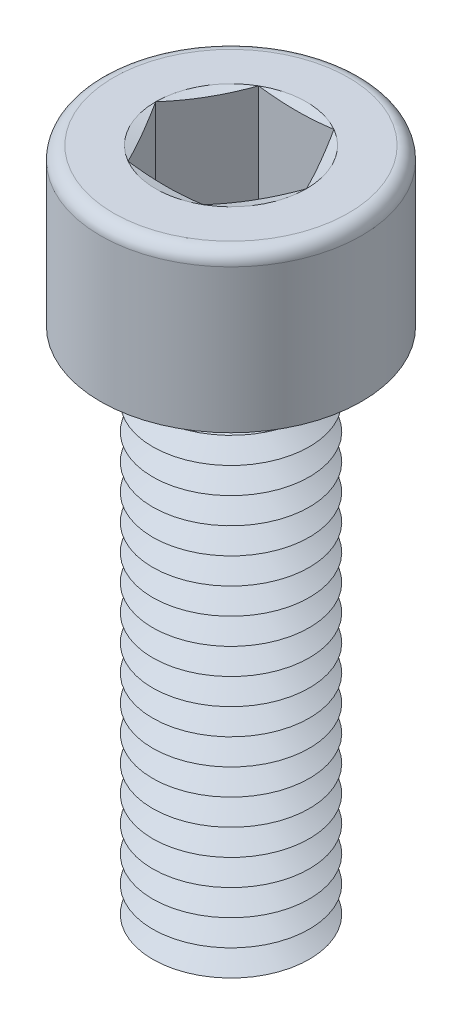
from build123d import *

# Parameters (mm, degrees)
SKETCH1_R       = 3
EXTRUDE1_DEPTH  = 20
SKETCH2_R       = 5
EXTRUDE2_DEPTH  = 6
EXTRUDE3_DEPTH  = 5
FILLET1_R       = 0.5
LPATTERN1_COUNT = 20
LPATTERN1_PITCH = 1


with BuildPart() as part:
    # Sketch1 → Extrude1 (new body)
    with BuildSketch(Plane(origin=(0, 0, 0), x_dir=(1, 0, 0), z_dir=(0, 1, 0))):
        with Locations(Location((0, 0, 0), (0, 0, 270))):
            Circle(SKETCH1_R)
    extrude(amount=EXTRUDE1_DEPTH)

    # Sketch2 → Extrude2 (add)
    with BuildSketch(Plane(origin=(0, 20, 0), x_dir=(1, 0, 0), z_dir=(0, 1, 0))):
        with Locations(Location((0, 0, 0), (0, 0, 270))):
            Circle(SKETCH2_R)
    extrude(amount=EXTRUDE2_DEPTH)

    # Sketch3 → Extrude3 (cut)
    with BuildSketch(Plane(origin=(0, 26, 0), x_dir=(1, 0, 0), z_dir=(0, 1, 0))):
        Polygon((1.443375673, 2.5), (-1.443375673, 2.5), (-2.886751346, 0), (-1.443375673, -2.5), (1.443375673, -2.5), (2.886751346, 0), align=None)
    extrude(amount=-EXTRUDE3_DEPTH, mode=Mode.SUBTRACT)

    # Fillet1
    fillet1_edges = [part.edges().sort_by_distance(p)[0] for p in [
        (0, 26, -5),
    ]]
    fillet(fillet1_edges, radius=FILLET1_R)

    # Sketch4 → Cut-Revolve1 (revolve, cut)
    with BuildSketch(Plane(origin=(0, 0, 0), x_dir=(0, 0, -1), z_dir=(1, 0, 0))):
        Polygon((-2.5, 21), (0, 21), (0, 19.556624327), align=None)
    revolve(axis=Axis((0, 21, 0), (0, -1, 0)), mode=Mode.SUBTRACT)

    # Sketch5 → Cut-Revolve2 (revolve, cut)
    with BuildSketch(Plane.XY, mode=Mode.PRIVATE) as cut_revolve2_sk:
        Polygon((-3, 0.5), (-3, -0.5), (-2.133974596, 0), align=None)
    cut_revolve2 = revolve(cut_revolve2_sk.sketch.rotate(Axis((0, 20, 0), (0, -1, 0)), 270), axis=Axis((0, 20, 0), (0, -1, 0)), mode=Mode.SUBTRACT)

    # LPattern1: Cut-Revolve2 ×20
    with Locations(*[(0, i * LPATTERN1_PITCH, 0) for i in range(1, LPATTERN1_COUNT)]):
        add(cut_revolve2, mode=Mode.SUBTRACT)

    # Extrude4 cone 1 section (on through the dimple's axis) → Extrude4 (revolve, cut)
    with BuildSketch(Plane(origin=(0, 26, 0), x_dir=(0, 0, 1), z_dir=(1, 0, 0))):
        Polygon((0, 0), (2.886751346, 0), (0, 0.773502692), align=None)
    revolve(axis=Axis((0, 26, 0), (0, -1, 0)), mode=Mode.SUBTRACT)


solid = part.part
